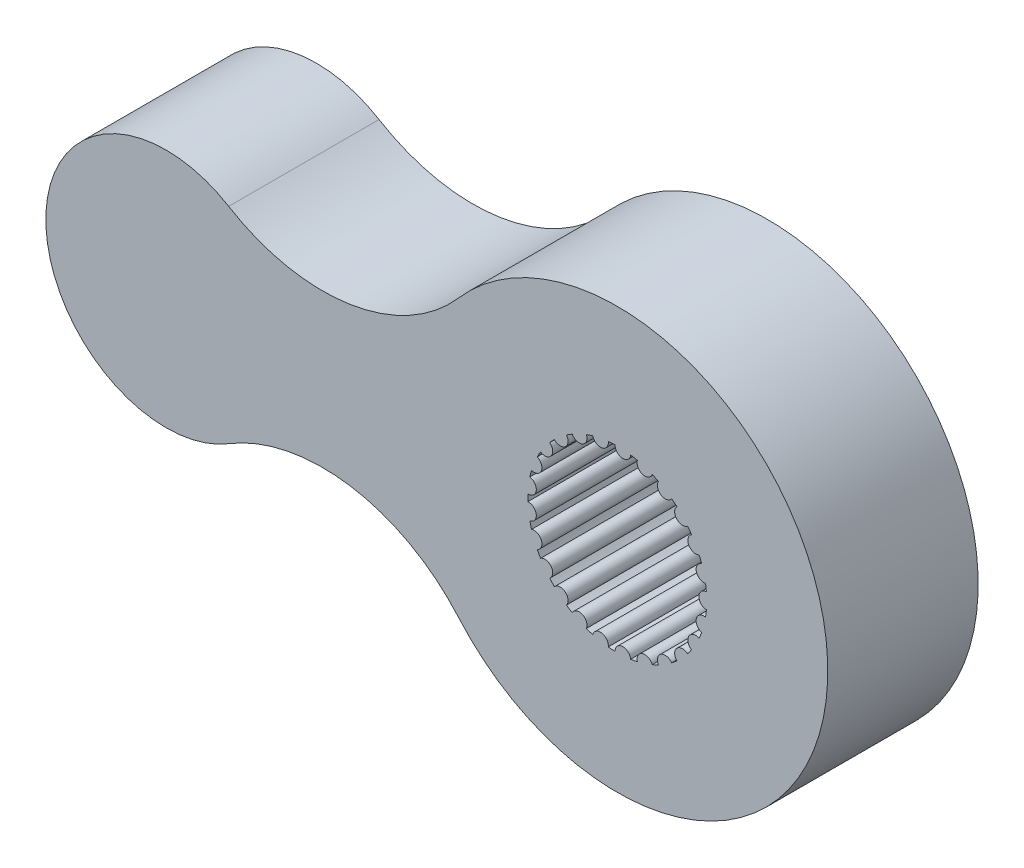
from build123d import *

# Parameters (mm, degrees)
ESQUISSE1_R        = 2.975
BOSS_EXTRU_1_DEPTH = 5
ESQUISSE2_R        = 0.26
BOSS_EXTRU_2_DEPTH = 5


with BuildPart() as part:
    # Esquisse1 → Boss.-Extru.1 (new body)
    with BuildSketch(Plane.XY):
        with BuildLine():
            ThreePointArc((-5.276923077, -4.599356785), (7, 0), (-5.276923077, 4.599356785))
            ThreePointArc((-5.276923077, 4.599356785), (-8.882478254, 2.612231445), (-12.92, 3.416665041))
            ThreePointArc((-12.92, 3.416665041), (-19, 0), (-12.92, -3.416665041))
            ThreePointArc((-12.92, -3.416665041), (-8.882478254, -2.612231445), (-5.276923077, -4.599356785))
        make_face()
        Circle(ESQUISSE1_R, mode=Mode.SUBTRACT)
    extrude(amount=BOSS_EXTRU_1_DEPTH)

    # Esquisse2 → Boss.-Extru.2 (add)
    with BuildSketch(Plane.XY.offset(5)):
        with Locations((2.975, 0)):
            Circle(ESQUISSE2_R)
        with Locations((2.881534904, -0.739852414)):
            Circle(ESQUISSE2_R)
        with Locations((2.607012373, -1.43321718)):
            Circle(ESQUISSE2_R)
        with Locations((2.168681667, -2.03652764)):
            Circle(ESQUISSE2_R)
        with Locations((1.594084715, -2.511875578)):
            Circle(ESQUISSE2_R)
        with Locations((0.919325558, -2.829393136)):
            Circle(ESQUISSE2_R)
        with Locations((0.186801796, -2.969129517)):
            Circle(ESQUISSE2_R)
        with Locations((-0.557459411, -2.922304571)):
            Circle(ESQUISSE2_R)
        with Locations((-1.266693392, -2.691860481)):
            Circle(ESQUISSE2_R)
        with Locations((-1.89633637, -2.292276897)):
            Circle(ESQUISSE2_R)
        with Locations((-2.406825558, -1.748661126)):
            Circle(ESQUISSE2_R)
        with Locations((-2.766085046, -1.095170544)):
            Circle(ESQUISSE2_R)
        with Locations((-2.951541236, -0.37286637)):
            Circle(ESQUISSE2_R)
        with Locations((-2.951541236, 0.37286637)):
            Circle(ESQUISSE2_R)
        with Locations((-2.766085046, 1.095170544)):
            Circle(ESQUISSE2_R)
        with Locations((-2.406825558, 1.748661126)):
            Circle(ESQUISSE2_R)
        with Locations((-1.89633637, 2.292276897)):
            Circle(ESQUISSE2_R)
        with Locations((-1.266693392, 2.691860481)):
            Circle(ESQUISSE2_R)
        with Locations((-0.557459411, 2.922304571)):
            Circle(ESQUISSE2_R)
        with Locations((0.186801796, 2.969129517)):
            Circle(ESQUISSE2_R)
        with Locations((0.919325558, 2.829393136)):
            Circle(ESQUISSE2_R)
        with Locations((1.594084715, 2.511875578)):
            Circle(ESQUISSE2_R)
        with Locations((2.168681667, 2.03652764)):
            Circle(ESQUISSE2_R)
        with Locations((2.607012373, 1.43321718)):
            Circle(ESQUISSE2_R)
        with Locations((2.881534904, 0.739852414)):
            Circle(ESQUISSE2_R)
    extrude(amount=-BOSS_EXTRU_2_DEPTH)


solid = part.part
